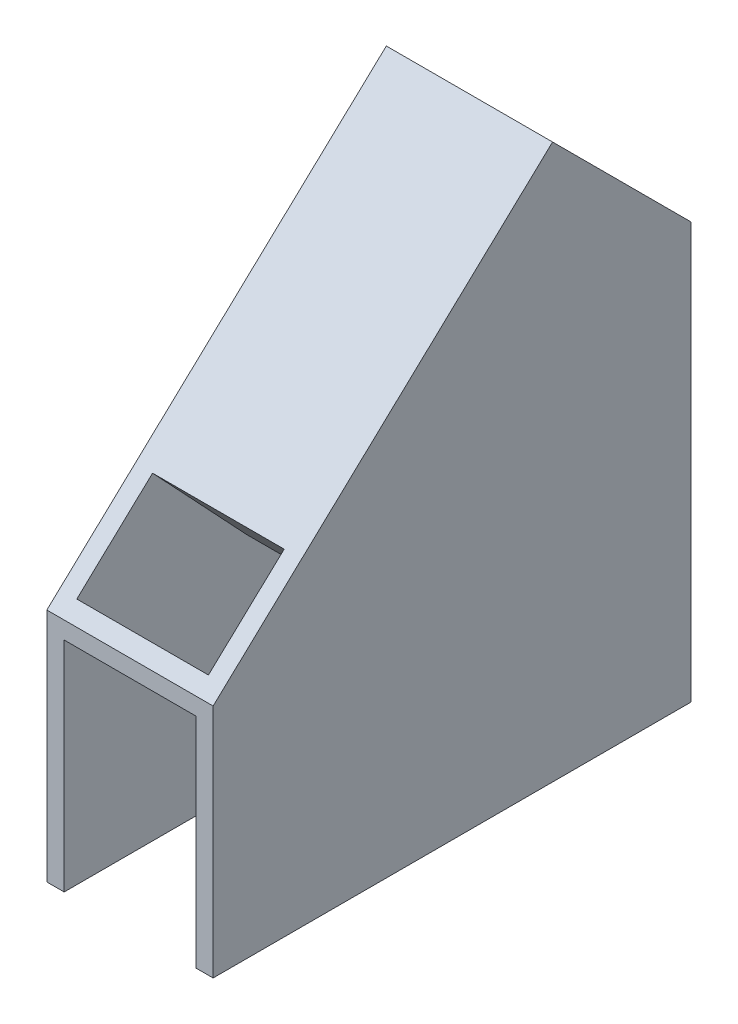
ISO-10303-21;
HEADER;
FILE_DESCRIPTION(('STEP AP214'),'2;1');
FILE_NAME('part.step','',(''),(''),'','','');
FILE_SCHEMA(('AUTOMOTIVE_DESIGN { 1 0 10303 214 1 1 1 1 }'));
ENDSEC;
DATA;
#1=APPLICATION_CONTEXT('core data for automotive mechanical design processes');
#2=APPLICATION_PROTOCOL_DEFINITION('international standard','automotive_design',2000,#1);
#3=PRODUCT_CONTEXT('',#1,'mechanical');
#4=PRODUCT('Part','Part','',(#3));
#5=PRODUCT_RELATED_PRODUCT_CATEGORY('part','',(#4));
#6=PRODUCT_DEFINITION_FORMATION('','',#4);
#7=PRODUCT_DEFINITION_CONTEXT('part definition',#1,'design');
#8=PRODUCT_DEFINITION('design','',#6,#7);
#9=PRODUCT_DEFINITION_SHAPE('','',#8);
#10=(LENGTH_UNIT() NAMED_UNIT(*) SI_UNIT(.MILLI.,.METRE.));
#11=(NAMED_UNIT(*) PLANE_ANGLE_UNIT() SI_UNIT($,.RADIAN.));
#12=(NAMED_UNIT(*) SI_UNIT($,.STERADIAN.) SOLID_ANGLE_UNIT());
#13=UNCERTAINTY_MEASURE_WITH_UNIT(LENGTH_MEASURE(1.E-05),#10,'distance_accuracy_value','');
#14=(GEOMETRIC_REPRESENTATION_CONTEXT(3) GLOBAL_UNCERTAINTY_ASSIGNED_CONTEXT((#13)) GLOBAL_UNIT_ASSIGNED_CONTEXT((#10,
#11,#12)) REPRESENTATION_CONTEXT('',''));
#15=CARTESIAN_POINT('',(0.,0.,0.));
#16=DIRECTION('',(0.,0.,1.));
#17=DIRECTION('',(1.,0.,0.));
#18=AXIS2_PLACEMENT_3D('',#15,#16,#17);
#19=CARTESIAN_POINT('',(-1.9,6.29999999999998,0.39999999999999));
#20=DIRECTION('',(0.,1.,0.));
#21=DIRECTION('',(0.,0.,1.));
#22=AXIS2_PLACEMENT_3D('',#19,#20,#21);
#23=PLANE('',#22);
#24=DIRECTION('',(0.,0.,1.));
#25=VECTOR('',#24,1.);
#26=CARTESIAN_POINT('',(1.9,6.29999999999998,0.39999999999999));
#27=LINE('',#26,#25);
#28=CARTESIAN_POINT('',(1.9,6.29999999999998,0.39999999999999));
#29=VERTEX_POINT('',#28);
#30=CARTESIAN_POINT('',(1.9,6.29999999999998,1.62999578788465));
#31=VERTEX_POINT('',#30);
#32=EDGE_CURVE('E182',#29,#31,#27,.T.);
#33=ORIENTED_EDGE('',*,*,#32,.T.);
#34=DIRECTION('',(-1.,0.,0.));
#35=VECTOR('',#34,1.);
#36=CARTESIAN_POINT('',(-1.9,6.29999999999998,1.62999578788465));
#37=LINE('',#36,#35);
#38=CARTESIAN_POINT('',(-1.9,6.29999999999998,1.62999578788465));
#39=VERTEX_POINT('',#38);
#40=EDGE_CURVE('E155',#31,#39,#37,.T.);
#41=ORIENTED_EDGE('',*,*,#40,.T.);
#42=DIRECTION('',(0.,0.,1.));
#43=VECTOR('',#42,1.);
#44=CARTESIAN_POINT('',(-1.9,6.29999999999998,0.39999999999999));
#45=LINE('',#44,#43);
#46=CARTESIAN_POINT('',(-1.9,6.29999999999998,0.39999999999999));
#47=VERTEX_POINT('',#46);
#48=EDGE_CURVE('E177',#47,#39,#45,.T.);
#49=ORIENTED_EDGE('',*,*,#48,.F.);
#50=DIRECTION('',(-1.,0.,0.));
#51=VECTOR('',#50,1.);
#52=CARTESIAN_POINT('',(-1.9,6.29999999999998,0.39999999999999));
#53=LINE('',#52,#51);
#54=EDGE_CURVE('E168',#29,#47,#53,.T.);
#55=ORIENTED_EDGE('',*,*,#54,.F.);
#56=EDGE_LOOP('',(#33,#41,#49,#55));
#57=FACE_BOUND('',#56,.T.);
#58=ADVANCED_FACE('F32',(#57),#23,.F.);
#59=CARTESIAN_POINT('',(2.4,16.,6.89999999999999));
#60=DIRECTION('',(-1.,0.,0.));
#61=DIRECTION('',(0.,0.,1.));
#62=AXIS2_PLACEMENT_3D('',#59,#60,#61);
#63=PLANE('',#62);
#64=DIRECTION('',(0.,-0.707106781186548,-0.707106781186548));
#65=VECTOR('',#64,1.);
#66=CARTESIAN_POINT('',(2.4,16.,-2.89999999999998));
#67=LINE('',#66,#65);
#68=CARTESIAN_POINT('',(2.4,12.,-6.89999999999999));
#69=VERTEX_POINT('',#68);
#70=CARTESIAN_POINT('',(2.4,16.,-2.89999999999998));
#71=VERTEX_POINT('',#70);
#72=EDGE_CURVE('E223',#69,#71,#67,.F.);
#73=ORIENTED_EDGE('',*,*,#72,.T.);
#74=DIRECTION('',(0.,0.68443590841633,-0.729073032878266));
#75=VECTOR('',#74,1.);
#76=CARTESIAN_POINT('',(2.4,16.,-2.90000000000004));
#77=LINE('',#76,#75);
#78=CARTESIAN_POINT('',(2.4,6.79999999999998,6.89999999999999));
#79=VERTEX_POINT('',#78);
#80=EDGE_CURVE('E226',#71,#79,#77,.F.);
#81=ORIENTED_EDGE('',*,*,#80,.T.);
#82=DIRECTION('',(0.,-1.,0.));
#83=VECTOR('',#82,1.);
#84=CARTESIAN_POINT('',(2.4,16.,6.89999999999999));
#85=LINE('',#84,#83);
#86=CARTESIAN_POINT('',(2.4,0.,6.89999999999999));
#87=VERTEX_POINT('',#86);
#88=EDGE_CURVE('E207',#79,#87,#85,.T.);
#89=ORIENTED_EDGE('',*,*,#88,.T.);
#90=DIRECTION('',(0.,0.,-1.));
#91=VECTOR('',#90,1.);
#92=CARTESIAN_POINT('',(2.4,0.,6.89999999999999));
#93=LINE('',#92,#91);
#94=CARTESIAN_POINT('',(2.4,0.,-6.89999999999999));
#95=VERTEX_POINT('',#94);
#96=EDGE_CURVE('E192',#87,#95,#93,.T.);
#97=ORIENTED_EDGE('',*,*,#96,.T.);
#98=DIRECTION('',(0.,-1.,0.));
#99=VECTOR('',#98,1.);
#100=CARTESIAN_POINT('',(2.4,16.,-6.89999999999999));
#101=LINE('',#100,#99);
#102=EDGE_CURVE('E214',#69,#95,#101,.T.);
#103=ORIENTED_EDGE('',*,*,#102,.F.);
#104=EDGE_LOOP('',(#73,#81,#89,#97,#103));
#105=FACE_BOUND('',#104,.T.);
#106=ADVANCED_FACE('F264',(#105),#63,.F.);
#107=CARTESIAN_POINT('',(-2.4,16.,-6.89999999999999));
#108=DIRECTION('',(0.,0.,1.));
#109=DIRECTION('',(1.,0.,0.));
#110=AXIS2_PLACEMENT_3D('',#107,#108,#109);
#111=PLANE('',#110);
#112=DIRECTION('',(0.,-1.,0.));
#113=VECTOR('',#112,1.);
#114=CARTESIAN_POINT('',(-2.4,16.,-6.89999999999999));
#115=LINE('',#114,#113);
#116=CARTESIAN_POINT('',(-2.4,12.,-6.89999999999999));
#117=VERTEX_POINT('',#116);
#118=CARTESIAN_POINT('',(-2.4,0.,-6.89999999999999));
#119=VERTEX_POINT('',#118);
#120=EDGE_CURVE('E212',#117,#119,#115,.T.);
#121=ORIENTED_EDGE('',*,*,#120,.F.);
#122=DIRECTION('',(1.,0.,0.));
#123=VECTOR('',#122,1.);
#124=CARTESIAN_POINT('',(-2.4,12.,-6.89999999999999));
#125=LINE('',#124,#123);
#126=EDGE_CURVE('E221',#117,#69,#125,.T.);
#127=ORIENTED_EDGE('',*,*,#126,.T.);
#128=ORIENTED_EDGE('',*,*,#102,.T.);
#129=DIRECTION('',(-1.,0.,0.));
#130=VECTOR('',#129,1.);
#131=CARTESIAN_POINT('',(-2.4,0.,-6.89999999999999));
#132=LINE('',#131,#130);
#133=EDGE_CURVE('E197',#95,#119,#132,.T.);
#134=ORIENTED_EDGE('',*,*,#133,.T.);
#135=EDGE_LOOP('',(#121,#127,#128,#134));
#136=FACE_BOUND('',#135,.T.);
#137=ADVANCED_FACE('F245',(#136),#111,.F.);
#138=CARTESIAN_POINT('',(-2.4,16.,6.89999999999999));
#139=DIRECTION('',(1.,0.,0.));
#140=DIRECTION('',(0.,0.,-1.));
#141=AXIS2_PLACEMENT_3D('',#138,#139,#140);
#142=PLANE('',#141);
#143=DIRECTION('',(0.,-1.,0.));
#144=VECTOR('',#143,1.);
#145=CARTESIAN_POINT('',(-2.4,16.,6.89999999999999));
#146=LINE('',#145,#144);
#147=CARTESIAN_POINT('',(-2.4,6.79999999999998,6.89999999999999));
#148=VERTEX_POINT('',#147);
#149=CARTESIAN_POINT('',(-2.4,0.,6.89999999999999));
#150=VERTEX_POINT('',#149);
#151=EDGE_CURVE('E210',#148,#150,#146,.T.);
#152=ORIENTED_EDGE('',*,*,#151,.F.);
#153=DIRECTION('',(0.,-0.68443590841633,0.729073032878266));
#154=VECTOR('',#153,1.);
#155=CARTESIAN_POINT('',(-2.4,16.,-2.90000000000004));
#156=LINE('',#155,#154);
#157=CARTESIAN_POINT('',(-2.4,16.,-2.89999999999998));
#158=VERTEX_POINT('',#157);
#159=EDGE_CURVE('E11',#148,#158,#156,.F.);
#160=ORIENTED_EDGE('',*,*,#159,.T.);
#161=DIRECTION('',(0.,0.707106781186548,0.707106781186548));
#162=VECTOR('',#161,1.);
#163=CARTESIAN_POINT('',(-2.4,16.,-2.89999999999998));
#164=LINE('',#163,#162);
#165=EDGE_CURVE('E219',#158,#117,#164,.F.);
#166=ORIENTED_EDGE('',*,*,#165,.T.);
#167=ORIENTED_EDGE('',*,*,#120,.T.);
#168=DIRECTION('',(0.,0.,1.));
#169=VECTOR('',#168,1.);
#170=CARTESIAN_POINT('',(-2.4,0.,6.89999999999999));
#171=LINE('',#170,#169);
#172=EDGE_CURVE('E200',#119,#150,#171,.T.);
#173=ORIENTED_EDGE('',*,*,#172,.T.);
#174=EDGE_LOOP('',(#152,#160,#166,#167,#173));
#175=FACE_BOUND('',#174,.T.);
#176=ADVANCED_FACE('F234',(#175),#142,.F.);
#177=CARTESIAN_POINT('',(-2.4,16.,6.89999999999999));
#178=DIRECTION('',(0.,0.,-1.));
#179=DIRECTION('',(-1.,0.,0.));
#180=AXIS2_PLACEMENT_3D('',#177,#178,#179);
#181=PLANE('',#180);
#182=DIRECTION('',(1.,0.,0.));
#183=VECTOR('',#182,1.);
#184=CARTESIAN_POINT('',(-2.4,0.,6.89999999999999));
#185=LINE('',#184,#183);
#186=CARTESIAN_POINT('',(-1.9,0.,6.89999999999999));
#187=VERTEX_POINT('',#186);
#188=EDGE_CURVE('E204',#150,#187,#185,.T.);
#189=ORIENTED_EDGE('',*,*,#188,.T.);
#190=DIRECTION('',(0.,-1.,0.));
#191=VECTOR('',#190,1.);
#192=CARTESIAN_POINT('',(-1.9,0.,6.89999999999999));
#193=LINE('',#192,#191);
#194=CARTESIAN_POINT('',(-1.9,6.29999999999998,6.89999999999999));
#195=VERTEX_POINT('',#194);
#196=EDGE_CURVE('E158',#195,#187,#193,.T.);
#197=ORIENTED_EDGE('',*,*,#196,.F.);
#198=DIRECTION('',(-1.,0.,0.));
#199=VECTOR('',#198,1.);
#200=CARTESIAN_POINT('',(-1.9,6.29999999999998,6.89999999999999));
#201=LINE('',#200,#199);
#202=CARTESIAN_POINT('',(1.9,6.29999999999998,6.89999999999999));
#203=VERTEX_POINT('',#202);
#204=EDGE_CURVE('E162',#203,#195,#201,.T.);
#205=ORIENTED_EDGE('',*,*,#204,.F.);
#206=DIRECTION('',(0.,1.,0.));
#207=VECTOR('',#206,1.);
#208=CARTESIAN_POINT('',(1.9,6.29999999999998,6.89999999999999));
#209=LINE('',#208,#207);
#210=CARTESIAN_POINT('',(1.9,0.,6.89999999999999));
#211=VERTEX_POINT('',#210);
#212=EDGE_CURVE('E173',#211,#203,#209,.T.);
#213=ORIENTED_EDGE('',*,*,#212,.F.);
#214=EDGE_CURVE('E203',#211,#87,#185,.T.);
#215=ORIENTED_EDGE('',*,*,#214,.T.);
#216=ORIENTED_EDGE('',*,*,#88,.F.);
#217=DIRECTION('',(-1.,0.,0.));
#218=VECTOR('',#217,1.);
#219=CARTESIAN_POINT('',(-2.4,6.79999999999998,6.89999999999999));
#220=LINE('',#219,#218);
#221=EDGE_CURVE('E40',#79,#148,#220,.T.);
#222=ORIENTED_EDGE('',*,*,#221,.T.);
#223=ORIENTED_EDGE('',*,*,#151,.T.);
#224=EDGE_LOOP('',(#189,#197,#205,#213,#215,#216,#222,#223));
#225=FACE_BOUND('',#224,.T.);
#226=ADVANCED_FACE('F231',(#225),#181,.F.);
#227=CARTESIAN_POINT('',(0.,0.,0.));
#228=DIRECTION('',(0.,-1.,0.));
#229=DIRECTION('',(0.,0.,-1.));
#230=AXIS2_PLACEMENT_3D('',#227,#228,#229);
#231=PLANE('',#230);
#232=DIRECTION('',(0.,0.,1.));
#233=VECTOR('',#232,1.);
#234=CARTESIAN_POINT('',(-1.9,0.,0.39999999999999));
#235=LINE('',#234,#233);
#236=CARTESIAN_POINT('',(-1.9,0.,0.39999999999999));
#237=VERTEX_POINT('',#236);
#238=EDGE_CURVE('E171',#237,#187,#235,.T.);
#239=ORIENTED_EDGE('',*,*,#238,.T.);
#240=ORIENTED_EDGE('',*,*,#188,.F.);
#241=ORIENTED_EDGE('',*,*,#172,.F.);
#242=ORIENTED_EDGE('',*,*,#133,.F.);
#243=ORIENTED_EDGE('',*,*,#96,.F.);
#244=ORIENTED_EDGE('',*,*,#214,.F.);
#245=DIRECTION('',(0.,0.,1.));
#246=VECTOR('',#245,1.);
#247=CARTESIAN_POINT('',(1.9,0.,0.39999999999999));
#248=LINE('',#247,#246);
#249=CARTESIAN_POINT('',(1.9,0.,0.39999999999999));
#250=VERTEX_POINT('',#249);
#251=EDGE_CURVE('E185',#250,#211,#248,.T.);
#252=ORIENTED_EDGE('',*,*,#251,.F.);
#253=DIRECTION('',(1.,0.,0.));
#254=VECTOR('',#253,1.);
#255=CARTESIAN_POINT('',(-1.9,0.,0.39999999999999));
#256=LINE('',#255,#254);
#257=EDGE_CURVE('E161',#237,#250,#256,.T.);
#258=ORIENTED_EDGE('',*,*,#257,.F.);
#259=EDGE_LOOP('',(#239,#240,#241,#242,#243,#244,#252,#258));
#260=FACE_BOUND('',#259,.T.);
#261=ADVANCED_FACE('F250',(#260),#231,.T.);
#262=CARTESIAN_POINT('',(0.,16.,-2.89999999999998));
#263=DIRECTION('',(0.,-0.707106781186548,0.707106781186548));
#264=DIRECTION('',(-1.,0.,0.));
#265=AXIS2_PLACEMENT_3D('',#262,#263,#264);
#266=PLANE('',#265);
#267=CARTESIAN_POINT('',(0.,14.,-4.89999999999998));
#268=DIRECTION('',(0.,0.707106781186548,-0.707106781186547));
#269=DIRECTION('',(0.,0.707106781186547,0.707106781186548));
#270=AXIS2_PLACEMENT_3D('',#267,#268,#269);
#271=CIRCLE('',#270,1.6);
#272=CARTESIAN_POINT('',(0.,15.1313708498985,-3.76862915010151));
#273=VERTEX_POINT('',#272);
#274=EDGE_CURVE('E180',#273,#273,#271,.T.);
#275=ORIENTED_EDGE('',*,*,#274,.F.);
#276=EDGE_LOOP('',(#275));
#277=FACE_BOUND('',#276,.T.);
#278=ORIENTED_EDGE('',*,*,#72,.F.);
#279=ORIENTED_EDGE('',*,*,#126,.F.);
#280=ORIENTED_EDGE('',*,*,#165,.F.);
#281=DIRECTION('',(-1.,0.,0.));
#282=VECTOR('',#281,1.);
#283=CARTESIAN_POINT('',(0.,16.,-2.89999999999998));
#284=LINE('',#283,#282);
#285=EDGE_CURVE('E216',#71,#158,#284,.T.);
#286=ORIENTED_EDGE('',*,*,#285,.F.);
#287=EDGE_LOOP('',(#278,#279,#280,#286));
#288=FACE_BOUND('',#287,.T.);
#289=ADVANCED_FACE('F241',(#277,#288),#266,.F.);
#290=CARTESIAN_POINT('',(0.,16.,-2.90000000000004));
#291=DIRECTION('',(0.,-0.729073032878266,-0.68443590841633));
#292=DIRECTION('',(1.,0.,0.));
#293=AXIS2_PLACEMENT_3D('',#290,#291,#292);
#294=PLANE('',#293);
#295=DIRECTION('',(0.,-0.68443590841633,0.729073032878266));
#296=VECTOR('',#295,1.);
#297=CARTESIAN_POINT('',(-1.9,7.14221795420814,6.53546348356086));
#298=LINE('',#297,#296);
#299=CARTESIAN_POINT('',(-1.9,9.19552567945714,4.34824438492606));
#300=VERTEX_POINT('',#299);
#301=CARTESIAN_POINT('',(-1.9,7.14221795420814,6.53546348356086));
#302=VERTEX_POINT('',#301);
#303=EDGE_CURVE('E47',#300,#302,#298,.T.);
#304=ORIENTED_EDGE('',*,*,#303,.F.);
#305=DIRECTION('',(-1.,0.,0.));
#306=VECTOR('',#305,1.);
#307=CARTESIAN_POINT('',(-1.9,9.19552567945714,4.34824438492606));
#308=LINE('',#307,#306);
#309=CARTESIAN_POINT('',(1.9,9.19552567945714,4.34824438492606));
#310=VERTEX_POINT('',#309);
#311=EDGE_CURVE('E144',#310,#300,#308,.T.);
#312=ORIENTED_EDGE('',*,*,#311,.F.);
#313=DIRECTION('',(0.,0.68443590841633,-0.729073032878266));
#314=VECTOR('',#313,1.);
#315=CARTESIAN_POINT('',(1.9,9.19552567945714,4.34824438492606));
#316=LINE('',#315,#314);
#317=CARTESIAN_POINT('',(1.9,7.14221795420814,6.53546348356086));
#318=VERTEX_POINT('',#317);
#319=EDGE_CURVE('E130',#318,#310,#316,.T.);
#320=ORIENTED_EDGE('',*,*,#319,.F.);
#321=DIRECTION('',(1.,0.,0.));
#322=VECTOR('',#321,1.);
#323=CARTESIAN_POINT('',(1.9,7.14221795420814,6.53546348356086));
#324=LINE('',#323,#322);
#325=EDGE_CURVE('E138',#302,#318,#324,.T.);
#326=ORIENTED_EDGE('',*,*,#325,.F.);
#327=EDGE_LOOP('',(#304,#312,#320,#326));
#328=FACE_BOUND('',#327,.T.);
#329=ORIENTED_EDGE('',*,*,#159,.F.);
#330=ORIENTED_EDGE('',*,*,#221,.F.);
#331=ORIENTED_EDGE('',*,*,#80,.F.);
#332=ORIENTED_EDGE('',*,*,#285,.T.);
#333=EDGE_LOOP('',(#329,#330,#331,#332));
#334=FACE_BOUND('',#333,.T.);
#335=ADVANCED_FACE('F34',(#328,#334),#294,.F.);
#336=CARTESIAN_POINT('',(0.,12.5857864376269,-3.48578643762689));
#337=DIRECTION('',(0.,0.707106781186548,-0.707106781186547));
#338=DIRECTION('',(0.,0.707106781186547,0.707106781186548));
#339=AXIS2_PLACEMENT_3D('',#336,#337,#338);
#340=CYLINDRICAL_SURFACE('',#339,1.6);
#341=CARTESIAN_POINT('',(0.,12.5857864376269,-3.48578643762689));
#342=DIRECTION('',(0.,0.707106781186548,-0.707106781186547));
#343=DIRECTION('',(0.,0.707106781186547,0.707106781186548));
#344=AXIS2_PLACEMENT_3D('',#341,#342,#343);
#345=CIRCLE('',#344,1.6);
#346=CARTESIAN_POINT('',(0.,13.7171572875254,-2.35441558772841));
#347=VERTEX_POINT('',#346);
#348=EDGE_CURVE('E189',#347,#347,#345,.T.);
#349=ORIENTED_EDGE('',*,*,#348,.F.);
#350=EDGE_LOOP('',(#349));
#351=FACE_BOUND('',#350,.T.);
#352=ORIENTED_EDGE('',*,*,#274,.T.);
#353=EDGE_LOOP('',(#352));
#354=FACE_BOUND('',#353,.T.);
#355=ADVANCED_FACE('F281',(#351,#354),#340,.F.);
#356=CARTESIAN_POINT('',(0.,12.5857864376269,-3.48578643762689));
#357=DIRECTION('',(0.,0.707106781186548,-0.707106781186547));
#358=DIRECTION('',(0.,0.707106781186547,0.707106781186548));
#359=AXIS2_PLACEMENT_3D('',#356,#357,#358);
#360=PLANE('',#359);
#361=ORIENTED_EDGE('',*,*,#348,.T.);
#362=EDGE_LOOP('',(#361));
#363=FACE_BOUND('',#362,.T.);
#364=ADVANCED_FACE('F286',(#363),#360,.T.);
#365=CARTESIAN_POINT('',(-1.9,0.,0.39999999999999));
#366=DIRECTION('',(-1.,0.,0.));
#367=DIRECTION('',(0.,-1.,0.));
#368=AXIS2_PLACEMENT_3D('',#365,#366,#367);
#369=PLANE('',#368);
#370=DIRECTION('',(0.,0.729073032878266,0.68443590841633));
#371=VECTOR('',#370,1.);
#372=CARTESIAN_POINT('',(-1.9,3.49685278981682,3.1132839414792));
#373=LINE('',#372,#371);
#374=CARTESIAN_POINT('',(-1.9,6.29999999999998,5.74480989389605));
#375=VERTEX_POINT('',#374);
#376=EDGE_CURVE('E135',#375,#302,#373,.T.);
#377=ORIENTED_EDGE('',*,*,#376,.F.);
#378=EDGE_CURVE('E181',#375,#195,#45,.T.);
#379=ORIENTED_EDGE('',*,*,#378,.T.);
#380=ORIENTED_EDGE('',*,*,#196,.T.);
#381=ORIENTED_EDGE('',*,*,#238,.F.);
#382=DIRECTION('',(0.,-1.,0.));
#383=VECTOR('',#382,1.);
#384=CARTESIAN_POINT('',(-1.9,0.,0.39999999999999));
#385=LINE('',#384,#383);
#386=EDGE_CURVE('E159',#47,#237,#385,.T.);
#387=ORIENTED_EDGE('',*,*,#386,.F.);
#388=ORIENTED_EDGE('',*,*,#48,.T.);
#389=DIRECTION('',(0.,0.729073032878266,0.68443590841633));
#390=VECTOR('',#389,1.);
#391=CARTESIAN_POINT('',(-1.9,5.55016051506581,0.926064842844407));
#392=LINE('',#391,#390);
#393=EDGE_CURVE('E149',#39,#300,#392,.T.);
#394=ORIENTED_EDGE('',*,*,#393,.T.);
#395=ORIENTED_EDGE('',*,*,#303,.T.);
#396=EDGE_LOOP('',(#377,#379,#380,#381,#387,#388,#394,#395));
#397=FACE_BOUND('',#396,.T.);
#398=ADVANCED_FACE('F256',(#397),#369,.F.);
#399=ORIENTED_EDGE('',*,*,#378,.F.);
#400=DIRECTION('',(1.,0.,0.));
#401=VECTOR('',#400,1.);
#402=CARTESIAN_POINT('',(-1.9,6.29999999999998,5.74480989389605));
#403=LINE('',#402,#401);
#404=CARTESIAN_POINT('',(1.9,6.29999999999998,5.74480989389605));
#405=VERTEX_POINT('',#404);
#406=EDGE_CURVE('E151',#375,#405,#403,.T.);
#407=ORIENTED_EDGE('',*,*,#406,.T.);
#408=EDGE_CURVE('E133',#405,#203,#27,.T.);
#409=ORIENTED_EDGE('',*,*,#408,.T.);
#410=ORIENTED_EDGE('',*,*,#204,.T.);
#411=EDGE_LOOP('',(#399,#407,#409,#410));
#412=FACE_BOUND('',#411,.T.);
#413=ADVANCED_FACE('F260',(#412),#23,.F.);
#414=CARTESIAN_POINT('',(1.9,6.29999999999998,0.39999999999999));
#415=DIRECTION('',(1.,0.,0.));
#416=DIRECTION('',(0.,0.,-1.));
#417=AXIS2_PLACEMENT_3D('',#414,#415,#416);
#418=PLANE('',#417);
#419=ORIENTED_EDGE('',*,*,#408,.F.);
#420=DIRECTION('',(0.,0.729073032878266,0.68443590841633));
#421=VECTOR('',#420,1.);
#422=CARTESIAN_POINT('',(1.9,3.49685278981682,3.1132839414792));
#423=LINE('',#422,#421);
#424=EDGE_CURVE('E55',#405,#318,#423,.T.);
#425=ORIENTED_EDGE('',*,*,#424,.T.);
#426=ORIENTED_EDGE('',*,*,#319,.T.);
#427=DIRECTION('',(0.,0.729073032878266,0.68443590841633));
#428=VECTOR('',#427,1.);
#429=CARTESIAN_POINT('',(1.9,5.55016051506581,0.926064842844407));
#430=LINE('',#429,#428);
#431=EDGE_CURVE('E134',#31,#310,#430,.T.);
#432=ORIENTED_EDGE('',*,*,#431,.F.);
#433=ORIENTED_EDGE('',*,*,#32,.F.);
#434=DIRECTION('',(0.,1.,0.));
#435=VECTOR('',#434,1.);
#436=CARTESIAN_POINT('',(1.9,6.29999999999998,0.39999999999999));
#437=LINE('',#436,#435);
#438=EDGE_CURVE('E165',#250,#29,#437,.T.);
#439=ORIENTED_EDGE('',*,*,#438,.F.);
#440=ORIENTED_EDGE('',*,*,#251,.T.);
#441=ORIENTED_EDGE('',*,*,#212,.T.);
#442=EDGE_LOOP('',(#419,#425,#426,#432,#433,#439,#440,#441));
#443=FACE_BOUND('',#442,.T.);
#444=ADVANCED_FACE('F127',(#443),#418,.F.);
#445=CARTESIAN_POINT('',(0.,0.,0.39999999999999));
#446=DIRECTION('',(0.,0.,-1.));
#447=DIRECTION('',(-1.,0.,0.));
#448=AXIS2_PLACEMENT_3D('',#445,#446,#447);
#449=PLANE('',#448);
#450=ORIENTED_EDGE('',*,*,#386,.T.);
#451=ORIENTED_EDGE('',*,*,#257,.T.);
#452=ORIENTED_EDGE('',*,*,#438,.T.);
#453=ORIENTED_EDGE('',*,*,#54,.T.);
#454=EDGE_LOOP('',(#450,#451,#452,#453));
#455=FACE_BOUND('',#454,.T.);
#456=ADVANCED_FACE('F318',(#455),#449,.F.);
#457=CARTESIAN_POINT('',(-1.9,5.55016051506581,0.926064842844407));
#458=DIRECTION('',(0.,0.68443590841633,-0.729073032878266));
#459=DIRECTION('',(0.,0.729073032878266,0.68443590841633));
#460=AXIS2_PLACEMENT_3D('',#457,#458,#459);
#461=PLANE('',#460);
#462=ORIENTED_EDGE('',*,*,#431,.T.);
#463=ORIENTED_EDGE('',*,*,#311,.T.);
#464=ORIENTED_EDGE('',*,*,#393,.F.);
#465=ORIENTED_EDGE('',*,*,#40,.F.);
#466=EDGE_LOOP('',(#462,#463,#464,#465));
#467=FACE_BOUND('',#466,.T.);
#468=ADVANCED_FACE('F323',(#467),#461,.F.);
#469=CARTESIAN_POINT('',(1.9,3.49685278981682,3.1132839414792));
#470=DIRECTION('',(0.,-0.68443590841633,0.729073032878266));
#471=DIRECTION('',(0.,-0.729073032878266,-0.68443590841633));
#472=AXIS2_PLACEMENT_3D('',#469,#470,#471);
#473=PLANE('',#472);
#474=ORIENTED_EDGE('',*,*,#376,.T.);
#475=ORIENTED_EDGE('',*,*,#325,.T.);
#476=ORIENTED_EDGE('',*,*,#424,.F.);
#477=ORIENTED_EDGE('',*,*,#406,.F.);
#478=EDGE_LOOP('',(#474,#475,#476,#477));
#479=FACE_BOUND('',#478,.T.);
#480=ADVANCED_FACE('F139',(#479),#473,.F.);
#481=CLOSED_SHELL('',(#58,#106,#137,#176,#226,#261,#289,#335,#355,#364,#398,#413,#444,#456,#468,#480));
#482=MANIFOLD_SOLID_BREP('B2',#481);
#483=ADVANCED_BREP_SHAPE_REPRESENTATION('',(#18,#482),#14);
#484=SHAPE_DEFINITION_REPRESENTATION(#9,#483);
ENDSEC;
END-ISO-10303-21;
